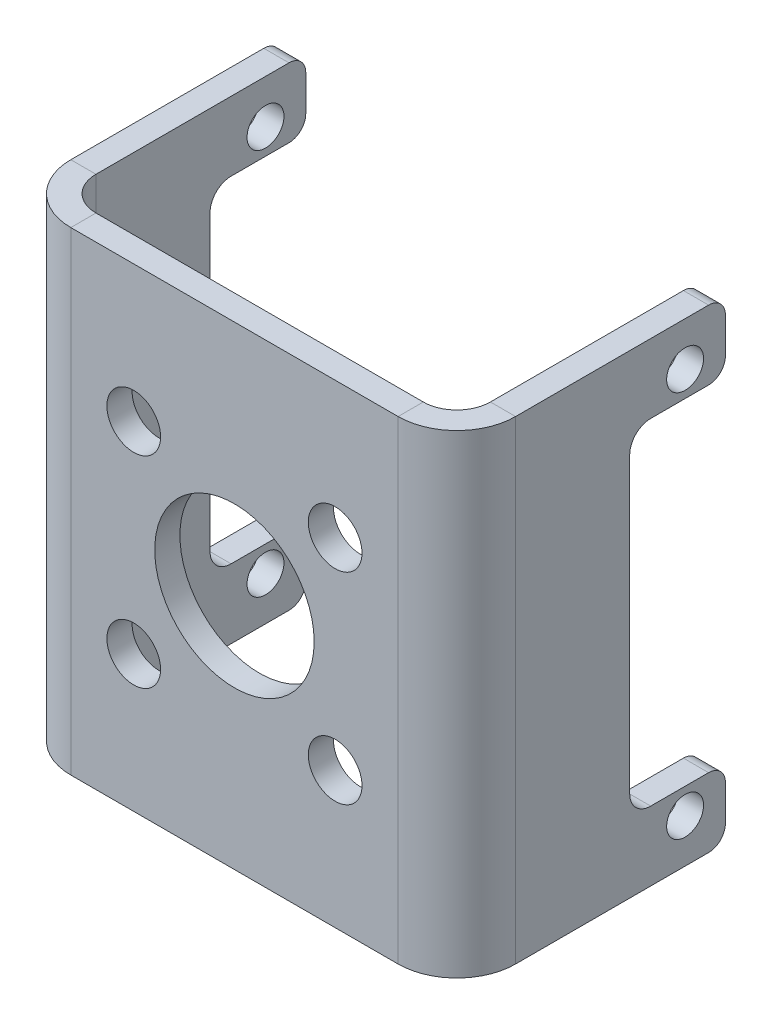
ISO-10303-21;
HEADER;
FILE_DESCRIPTION(('STEP AP214'),'2;1');
FILE_NAME('part.step','',(''),(''),'','','');
FILE_SCHEMA(('AUTOMOTIVE_DESIGN { 1 0 10303 214 1 1 1 1 }'));
ENDSEC;
DATA;
#1=APPLICATION_CONTEXT('core data for automotive mechanical design processes');
#2=APPLICATION_PROTOCOL_DEFINITION('international standard','automotive_design',2000,#1);
#3=PRODUCT_CONTEXT('',#1,'mechanical');
#4=PRODUCT('Part','Part','',(#3));
#5=PRODUCT_RELATED_PRODUCT_CATEGORY('part','',(#4));
#6=PRODUCT_DEFINITION_FORMATION('','',#4);
#7=PRODUCT_DEFINITION_CONTEXT('part definition',#1,'design');
#8=PRODUCT_DEFINITION('design','',#6,#7);
#9=PRODUCT_DEFINITION_SHAPE('','',#8);
#10=(LENGTH_UNIT() NAMED_UNIT(*) SI_UNIT(.MILLI.,.METRE.));
#11=(NAMED_UNIT(*) PLANE_ANGLE_UNIT() SI_UNIT($,.RADIAN.));
#12=(NAMED_UNIT(*) SI_UNIT($,.STERADIAN.) SOLID_ANGLE_UNIT());
#13=UNCERTAINTY_MEASURE_WITH_UNIT(LENGTH_MEASURE(1.E-05),#10,'distance_accuracy_value','');
#14=(GEOMETRIC_REPRESENTATION_CONTEXT(3) GLOBAL_UNCERTAINTY_ASSIGNED_CONTEXT((#13)) GLOBAL_UNIT_ASSIGNED_CONTEXT((#10,
#11,#12)) REPRESENTATION_CONTEXT('',''));
#15=CARTESIAN_POINT('',(0.,0.,0.));
#16=DIRECTION('',(0.,0.,1.));
#17=DIRECTION('',(1.,0.,0.));
#18=AXIS2_PLACEMENT_3D('',#15,#16,#17);
#19=CARTESIAN_POINT('',(13.25,14.125,-16.));
#20=DIRECTION('',(0.,0.,1.));
#21=DIRECTION('',(1.,0.,0.));
#22=AXIS2_PLACEMENT_3D('',#19,#20,#21);
#23=PLANE('',#22);
#24=DIRECTION('',(0.,1.,0.));
#25=VECTOR('',#24,1.);
#26=CARTESIAN_POINT('',(13.25,14.125,-16.));
#27=LINE('',#26,#25);
#28=CARTESIAN_POINT('',(13.25,-13.125,-16.));
#29=VERTEX_POINT('',#28);
#30=CARTESIAN_POINT('',(13.25,-11.0000000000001,-16.));
#31=VERTEX_POINT('',#30);
#32=EDGE_CURVE('E364',#29,#31,#27,.T.);
#33=ORIENTED_EDGE('',*,*,#32,.F.);
#34=DIRECTION('',(-1.,0.,0.));
#35=VECTOR('',#34,1.);
#36=CARTESIAN_POINT('',(13.25,-13.125,-16.));
#37=LINE('',#36,#35);
#38=CARTESIAN_POINT('',(11.75,-13.125,-16.));
#39=VERTEX_POINT('',#38);
#40=EDGE_CURVE('E500',#29,#39,#37,.T.);
#41=ORIENTED_EDGE('',*,*,#40,.T.);
#42=DIRECTION('',(0.,1.,0.));
#43=VECTOR('',#42,1.);
#44=CARTESIAN_POINT('',(11.75,14.125,-16.));
#45=LINE('',#44,#43);
#46=CARTESIAN_POINT('',(11.75,-11.0000000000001,-16.));
#47=VERTEX_POINT('',#46);
#48=EDGE_CURVE('E376',#39,#47,#45,.T.);
#49=ORIENTED_EDGE('',*,*,#48,.T.);
#50=DIRECTION('',(1.,0.,0.));
#51=VECTOR('',#50,1.);
#52=CARTESIAN_POINT('',(13.25,-11.0000000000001,-16.));
#53=LINE('',#52,#51);
#54=EDGE_CURVE('E496',#47,#31,#53,.T.);
#55=ORIENTED_EDGE('',*,*,#54,.T.);
#56=EDGE_LOOP('',(#33,#41,#49,#55));
#57=FACE_BOUND('',#56,.T.);
#58=ADVANCED_FACE('F46',(#57),#23,.F.);
#59=CARTESIAN_POINT('',(-13.25,-14.125,-16.));
#60=DIRECTION('',(0.,0.,1.));
#61=DIRECTION('',(1.,0.,0.));
#62=AXIS2_PLACEMENT_3D('',#59,#60,#61);
#63=PLANE('',#62);
#64=DIRECTION('',(0.,-1.,0.));
#65=VECTOR('',#64,1.);
#66=CARTESIAN_POINT('',(-11.75,-14.125,-16.));
#67=LINE('',#66,#65);
#68=CARTESIAN_POINT('',(-11.75,-11.0000000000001,-16.));
#69=VERTEX_POINT('',#68);
#70=CARTESIAN_POINT('',(-11.75,-13.125,-16.));
#71=VERTEX_POINT('',#70);
#72=EDGE_CURVE('E316',#69,#71,#67,.T.);
#73=ORIENTED_EDGE('',*,*,#72,.T.);
#74=DIRECTION('',(1.,0.,0.));
#75=VECTOR('',#74,1.);
#76=CARTESIAN_POINT('',(-13.25,-13.125,-16.));
#77=LINE('',#76,#75);
#78=CARTESIAN_POINT('',(-13.25,-13.125,-16.));
#79=VERTEX_POINT('',#78);
#80=EDGE_CURVE('E55',#71,#79,#77,.F.);
#81=ORIENTED_EDGE('',*,*,#80,.T.);
#82=DIRECTION('',(0.,-1.,0.));
#83=VECTOR('',#82,1.);
#84=CARTESIAN_POINT('',(-13.25,-14.125,-16.));
#85=LINE('',#84,#83);
#86=CARTESIAN_POINT('',(-13.25,-11.0000000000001,-16.));
#87=VERTEX_POINT('',#86);
#88=EDGE_CURVE('E298',#87,#79,#85,.T.);
#89=ORIENTED_EDGE('',*,*,#88,.F.);
#90=DIRECTION('',(1.,0.,0.));
#91=VECTOR('',#90,1.);
#92=CARTESIAN_POINT('',(-13.25,-11.0000000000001,-16.));
#93=LINE('',#92,#91);
#94=EDGE_CURVE('E587',#87,#69,#93,.T.);
#95=ORIENTED_EDGE('',*,*,#94,.T.);
#96=EDGE_LOOP('',(#73,#81,#89,#95));
#97=FACE_BOUND('',#96,.T.);
#98=ADVANCED_FACE('F595',(#97),#63,.F.);
#99=CARTESIAN_POINT('',(0.,0.,-1.5));
#100=DIRECTION('',(0.,0.,1.));
#101=DIRECTION('',(1.,0.,0.));
#102=AXIS2_PLACEMENT_3D('',#99,#100,#101);
#103=PLANE('',#102);
#104=CARTESIAN_POINT('',(6.,6.,-1.5));
#105=DIRECTION('',(0.,0.,1.));
#106=DIRECTION('',(1.,0.,0.));
#107=AXIS2_PLACEMENT_3D('',#104,#105,#106);
#108=CIRCLE('',#107,1.6);
#109=CARTESIAN_POINT('',(7.6,6.,-1.5));
#110=VERTEX_POINT('',#109);
#111=EDGE_CURVE('E616',#110,#110,#108,.T.);
#112=ORIENTED_EDGE('',*,*,#111,.T.);
#113=EDGE_LOOP('',(#112));
#114=FACE_BOUND('',#113,.T.);
#115=CARTESIAN_POINT('',(6.,-6.,-1.5));
#116=DIRECTION('',(0.,0.,1.));
#117=DIRECTION('',(1.,0.,0.));
#118=AXIS2_PLACEMENT_3D('',#115,#116,#117);
#119=CIRCLE('',#118,1.6);
#120=CARTESIAN_POINT('',(7.6,-6.,-1.5));
#121=VERTEX_POINT('',#120);
#122=EDGE_CURVE('E621',#121,#121,#119,.T.);
#123=ORIENTED_EDGE('',*,*,#122,.T.);
#124=EDGE_LOOP('',(#123));
#125=FACE_BOUND('',#124,.T.);
#126=CARTESIAN_POINT('',(0.,0.,-1.5));
#127=DIRECTION('',(0.,0.,1.));
#128=DIRECTION('',(1.,0.,0.));
#129=AXIS2_PLACEMENT_3D('',#126,#127,#128);
#130=CIRCLE('',#129,4.75);
#131=CARTESIAN_POINT('',(4.75,0.,-1.5));
#132=VERTEX_POINT('',#131);
#133=EDGE_CURVE('E625',#132,#132,#130,.T.);
#134=ORIENTED_EDGE('',*,*,#133,.T.);
#135=EDGE_LOOP('',(#134));
#136=FACE_BOUND('',#135,.T.);
#137=CARTESIAN_POINT('',(-6.,-6.,-1.5));
#138=DIRECTION('',(0.,0.,1.));
#139=DIRECTION('',(1.,0.,0.));
#140=AXIS2_PLACEMENT_3D('',#137,#138,#139);
#141=CIRCLE('',#140,1.6);
#142=CARTESIAN_POINT('',(-4.4,-6.,-1.5));
#143=VERTEX_POINT('',#142);
#144=EDGE_CURVE('E629',#143,#143,#141,.T.);
#145=ORIENTED_EDGE('',*,*,#144,.T.);
#146=EDGE_LOOP('',(#145));
#147=FACE_BOUND('',#146,.T.);
#148=CARTESIAN_POINT('',(-6.,6.,-1.5));
#149=DIRECTION('',(0.,0.,1.));
#150=DIRECTION('',(1.,0.,0.));
#151=AXIS2_PLACEMENT_3D('',#148,#149,#150);
#152=CIRCLE('',#151,1.6);
#153=CARTESIAN_POINT('',(-4.4,6.,-1.5));
#154=VERTEX_POINT('',#153);
#155=EDGE_CURVE('E633',#154,#154,#152,.T.);
#156=ORIENTED_EDGE('',*,*,#155,.T.);
#157=EDGE_LOOP('',(#156));
#158=FACE_BOUND('',#157,.T.);
#159=DIRECTION('',(0.,1.,0.));
#160=VECTOR('',#159,1.);
#161=CARTESIAN_POINT('',(-9.75000000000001,14.125,-1.5));
#162=LINE('',#161,#160);
#163=CARTESIAN_POINT('',(-9.75000000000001,14.125,-1.5));
#164=VERTEX_POINT('',#163);
#165=CARTESIAN_POINT('',(-9.75000000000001,-14.125,-1.5));
#166=VERTEX_POINT('',#165);
#167=EDGE_CURVE('E328',#164,#166,#162,.F.);
#168=ORIENTED_EDGE('',*,*,#167,.F.);
#169=DIRECTION('',(-1.,0.,0.));
#170=VECTOR('',#169,1.);
#171=CARTESIAN_POINT('',(11.75,14.125,-1.5));
#172=LINE('',#171,#170);
#173=CARTESIAN_POINT('',(9.75000000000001,14.125,-1.5));
#174=VERTEX_POINT('',#173);
#175=EDGE_CURVE('E414',#174,#164,#172,.T.);
#176=ORIENTED_EDGE('',*,*,#175,.F.);
#177=DIRECTION('',(0.,-1.,0.));
#178=VECTOR('',#177,1.);
#179=CARTESIAN_POINT('',(9.75000000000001,-14.125,-1.5));
#180=LINE('',#179,#178);
#181=CARTESIAN_POINT('',(9.75000000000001,-14.125,-1.5));
#182=VERTEX_POINT('',#181);
#183=EDGE_CURVE('E396',#182,#174,#180,.F.);
#184=ORIENTED_EDGE('',*,*,#183,.F.);
#185=DIRECTION('',(1.,0.,0.));
#186=VECTOR('',#185,1.);
#187=CARTESIAN_POINT('',(11.75,-14.125,-1.5));
#188=LINE('',#187,#186);
#189=EDGE_CURVE('E410',#166,#182,#188,.T.);
#190=ORIENTED_EDGE('',*,*,#189,.F.);
#191=EDGE_LOOP('',(#168,#176,#184,#190));
#192=FACE_BOUND('',#191,.T.);
#193=ADVANCED_FACE('F902',(#114,#125,#136,#147,#158,#192),#103,.F.);
#194=CARTESIAN_POINT('',(0.,0.,0.));
#195=DIRECTION('',(0.,0.,1.));
#196=DIRECTION('',(1.,0.,0.));
#197=AXIS2_PLACEMENT_3D('',#194,#195,#196);
#198=PLANE('',#197);
#199=CARTESIAN_POINT('',(6.,6.,0.));
#200=DIRECTION('',(0.,0.,1.));
#201=DIRECTION('',(1.,0.,0.));
#202=AXIS2_PLACEMENT_3D('',#199,#200,#201);
#203=CIRCLE('',#202,1.6);
#204=CARTESIAN_POINT('',(7.6,6.,0.));
#205=VERTEX_POINT('',#204);
#206=EDGE_CURVE('E641',#205,#205,#203,.T.);
#207=ORIENTED_EDGE('',*,*,#206,.F.);
#208=EDGE_LOOP('',(#207));
#209=FACE_BOUND('',#208,.T.);
#210=CARTESIAN_POINT('',(6.,-6.,0.));
#211=DIRECTION('',(0.,0.,1.));
#212=DIRECTION('',(1.,0.,0.));
#213=AXIS2_PLACEMENT_3D('',#210,#211,#212);
#214=CIRCLE('',#213,1.6);
#215=CARTESIAN_POINT('',(7.6,-6.,0.));
#216=VERTEX_POINT('',#215);
#217=EDGE_CURVE('E642',#216,#216,#214,.T.);
#218=ORIENTED_EDGE('',*,*,#217,.F.);
#219=EDGE_LOOP('',(#218));
#220=FACE_BOUND('',#219,.T.);
#221=CARTESIAN_POINT('',(0.,0.,0.));
#222=DIRECTION('',(0.,0.,1.));
#223=DIRECTION('',(1.,0.,0.));
#224=AXIS2_PLACEMENT_3D('',#221,#222,#223);
#225=CIRCLE('',#224,4.75);
#226=CARTESIAN_POINT('',(4.75,0.,0.));
#227=VERTEX_POINT('',#226);
#228=EDGE_CURVE('E653',#227,#227,#225,.T.);
#229=ORIENTED_EDGE('',*,*,#228,.F.);
#230=EDGE_LOOP('',(#229));
#231=FACE_BOUND('',#230,.T.);
#232=CARTESIAN_POINT('',(-6.,-6.,0.));
#233=DIRECTION('',(0.,0.,1.));
#234=DIRECTION('',(1.,0.,0.));
#235=AXIS2_PLACEMENT_3D('',#232,#233,#234);
#236=CIRCLE('',#235,1.6);
#237=CARTESIAN_POINT('',(-4.4,-6.,0.));
#238=VERTEX_POINT('',#237);
#239=EDGE_CURVE('E646',#238,#238,#236,.T.);
#240=ORIENTED_EDGE('',*,*,#239,.F.);
#241=EDGE_LOOP('',(#240));
#242=FACE_BOUND('',#241,.T.);
#243=CARTESIAN_POINT('',(-6.,6.,0.));
#244=DIRECTION('',(0.,0.,1.));
#245=DIRECTION('',(1.,0.,0.));
#246=AXIS2_PLACEMENT_3D('',#243,#244,#245);
#247=CIRCLE('',#246,1.6);
#248=CARTESIAN_POINT('',(-4.4,6.,0.));
#249=VERTEX_POINT('',#248);
#250=EDGE_CURVE('E637',#249,#249,#247,.T.);
#251=ORIENTED_EDGE('',*,*,#250,.F.);
#252=EDGE_LOOP('',(#251));
#253=FACE_BOUND('',#252,.T.);
#254=DIRECTION('',(-1.,0.,0.));
#255=VECTOR('',#254,1.);
#256=CARTESIAN_POINT('',(11.75,14.125,0.));
#257=LINE('',#256,#255);
#258=CARTESIAN_POINT('',(9.75000000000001,14.125,0.));
#259=VERTEX_POINT('',#258);
#260=CARTESIAN_POINT('',(-9.75000000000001,14.125,0.));
#261=VERTEX_POINT('',#260);
#262=EDGE_CURVE('E415',#259,#261,#257,.T.);
#263=ORIENTED_EDGE('',*,*,#262,.T.);
#264=DIRECTION('',(0.,1.,0.));
#265=VECTOR('',#264,1.);
#266=CARTESIAN_POINT('',(-9.75000000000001,14.125,0.));
#267=LINE('',#266,#265);
#268=CARTESIAN_POINT('',(-9.75000000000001,-14.125,0.));
#269=VERTEX_POINT('',#268);
#270=EDGE_CURVE('E264',#261,#269,#267,.F.);
#271=ORIENTED_EDGE('',*,*,#270,.T.);
#272=DIRECTION('',(1.,0.,0.));
#273=VECTOR('',#272,1.);
#274=CARTESIAN_POINT('',(11.75,-14.125,0.));
#275=LINE('',#274,#273);
#276=CARTESIAN_POINT('',(9.75000000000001,-14.125,0.));
#277=VERTEX_POINT('',#276);
#278=EDGE_CURVE('E406',#269,#277,#275,.T.);
#279=ORIENTED_EDGE('',*,*,#278,.T.);
#280=DIRECTION('',(0.,-1.,0.));
#281=VECTOR('',#280,1.);
#282=CARTESIAN_POINT('',(9.75000000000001,-14.125,0.));
#283=LINE('',#282,#281);
#284=EDGE_CURVE('E379',#277,#259,#283,.F.);
#285=ORIENTED_EDGE('',*,*,#284,.T.);
#286=EDGE_LOOP('',(#263,#271,#279,#285));
#287=FACE_BOUND('',#286,.T.);
#288=ADVANCED_FACE('F1159',(#209,#220,#231,#242,#253,#287),#198,.T.);
#289=CARTESIAN_POINT('',(11.75,14.125,-1.5));
#290=DIRECTION('',(0.,1.,0.));
#291=DIRECTION('',(-1.,0.,0.));
#292=AXIS2_PLACEMENT_3D('',#289,#290,#291);
#293=PLANE('',#292);
#294=ORIENTED_EDGE('',*,*,#175,.T.);
#295=DIRECTION('',(0.,0.,1.));
#296=VECTOR('',#295,1.);
#297=CARTESIAN_POINT('',(-9.75000000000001,14.125,-1.5));
#298=LINE('',#297,#296);
#299=EDGE_CURVE('E323',#164,#261,#298,.T.);
#300=ORIENTED_EDGE('',*,*,#299,.T.);
#301=ORIENTED_EDGE('',*,*,#262,.F.);
#302=DIRECTION('',(0.,0.,1.));
#303=VECTOR('',#302,1.);
#304=CARTESIAN_POINT('',(9.75000000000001,14.125,-1.5));
#305=LINE('',#304,#303);
#306=EDGE_CURVE('E402',#174,#259,#305,.T.);
#307=ORIENTED_EDGE('',*,*,#306,.F.);
#308=EDGE_LOOP('',(#294,#300,#301,#307));
#309=FACE_BOUND('',#308,.T.);
#310=ADVANCED_FACE('F1156',(#309),#293,.T.);
#311=CARTESIAN_POINT('',(11.75,-14.125,-1.5));
#312=DIRECTION('',(0.,-1.,0.));
#313=DIRECTION('',(1.,0.,0.));
#314=AXIS2_PLACEMENT_3D('',#311,#312,#313);
#315=PLANE('',#314);
#316=DIRECTION('',(0.,0.,1.));
#317=VECTOR('',#316,1.);
#318=CARTESIAN_POINT('',(-9.75000000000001,-14.125,-1.5));
#319=LINE('',#318,#317);
#320=EDGE_CURVE('E333',#166,#269,#319,.T.);
#321=ORIENTED_EDGE('',*,*,#320,.F.);
#322=ORIENTED_EDGE('',*,*,#189,.T.);
#323=DIRECTION('',(0.,0.,1.));
#324=VECTOR('',#323,1.);
#325=CARTESIAN_POINT('',(9.75000000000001,-14.125,-1.5));
#326=LINE('',#325,#324);
#327=EDGE_CURVE('E388',#182,#277,#326,.T.);
#328=ORIENTED_EDGE('',*,*,#327,.T.);
#329=ORIENTED_EDGE('',*,*,#278,.F.);
#330=EDGE_LOOP('',(#321,#322,#328,#329));
#331=FACE_BOUND('',#330,.T.);
#332=ADVANCED_FACE('F1167',(#331),#315,.T.);
#333=CARTESIAN_POINT('',(9.75000000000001,14.125,-3.5));
#334=DIRECTION('',(0.,1.,0.));
#335=DIRECTION('',(0.,0.,1.));
#336=AXIS2_PLACEMENT_3D('',#333,#334,#335);
#337=PLANE('',#336);
#338=DIRECTION('',(1.,0.,0.));
#339=VECTOR('',#338,1.);
#340=CARTESIAN_POINT('',(11.75,14.125,-3.49999999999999));
#341=LINE('',#340,#339);
#342=CARTESIAN_POINT('',(11.75,14.125,-3.49999999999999));
#343=VERTEX_POINT('',#342);
#344=CARTESIAN_POINT('',(13.25,14.125,-3.49999999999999));
#345=VERTEX_POINT('',#344);
#346=EDGE_CURVE('E337',#343,#345,#341,.T.);
#347=ORIENTED_EDGE('',*,*,#346,.F.);
#348=CARTESIAN_POINT('',(9.75000000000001,14.125,-3.5));
#349=DIRECTION('',(0.,-1.,0.));
#350=DIRECTION('',(0.,0.,-1.));
#351=AXIS2_PLACEMENT_3D('',#348,#349,#350);
#352=CIRCLE('',#351,2.);
#353=EDGE_CURVE('E392',#174,#343,#352,.F.);
#354=ORIENTED_EDGE('',*,*,#353,.F.);
#355=ORIENTED_EDGE('',*,*,#306,.T.);
#356=CARTESIAN_POINT('',(9.75000000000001,14.125,-3.5));
#357=DIRECTION('',(0.,-1.,0.));
#358=DIRECTION('',(0.,0.,-1.));
#359=AXIS2_PLACEMENT_3D('',#356,#357,#358);
#360=CIRCLE('',#359,3.5);
#361=EDGE_CURVE('E383',#259,#345,#360,.F.);
#362=ORIENTED_EDGE('',*,*,#361,.T.);
#363=EDGE_LOOP('',(#347,#354,#355,#362));
#364=FACE_BOUND('',#363,.T.);
#365=ADVANCED_FACE('F1146',(#364),#337,.T.);
#366=CARTESIAN_POINT('',(9.75000000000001,-14.125,-3.5));
#367=DIRECTION('',(0.,1.,0.));
#368=DIRECTION('',(0.,0.,1.));
#369=AXIS2_PLACEMENT_3D('',#366,#367,#368);
#370=PLANE('',#369);
#371=CARTESIAN_POINT('',(9.75000000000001,-14.125,-3.5));
#372=DIRECTION('',(0.,-1.,0.));
#373=DIRECTION('',(0.,0.,-1.));
#374=AXIS2_PLACEMENT_3D('',#371,#372,#373);
#375=CIRCLE('',#374,2.);
#376=CARTESIAN_POINT('',(11.75,-14.125,-3.49999999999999));
#377=VERTEX_POINT('',#376);
#378=EDGE_CURVE('E368',#377,#182,#375,.T.);
#379=ORIENTED_EDGE('',*,*,#378,.F.);
#380=DIRECTION('',(1.,0.,0.));
#381=VECTOR('',#380,1.);
#382=CARTESIAN_POINT('',(11.75,-14.125,-3.49999999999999));
#383=LINE('',#382,#381);
#384=CARTESIAN_POINT('',(13.25,-14.125,-3.49999999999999));
#385=VERTEX_POINT('',#384);
#386=EDGE_CURVE('E343',#377,#385,#383,.T.);
#387=ORIENTED_EDGE('',*,*,#386,.T.);
#388=CARTESIAN_POINT('',(9.75000000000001,-14.125,-3.5));
#389=DIRECTION('',(0.,-1.,0.));
#390=DIRECTION('',(0.,0.,-1.));
#391=AXIS2_PLACEMENT_3D('',#388,#389,#390);
#392=CIRCLE('',#391,3.5);
#393=EDGE_CURVE('E384',#385,#277,#392,.T.);
#394=ORIENTED_EDGE('',*,*,#393,.T.);
#395=ORIENTED_EDGE('',*,*,#327,.F.);
#396=EDGE_LOOP('',(#379,#387,#394,#395));
#397=FACE_BOUND('',#396,.T.);
#398=ADVANCED_FACE('F1164',(#397),#370,.F.);
#399=CARTESIAN_POINT('',(9.75000000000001,-14.125,-3.5));
#400=DIRECTION('',(0.,-1.,0.));
#401=DIRECTION('',(1.,0.,0.));
#402=AXIS2_PLACEMENT_3D('',#399,#400,#401);
#403=CYLINDRICAL_SURFACE('',#402,3.5);
#404=ORIENTED_EDGE('',*,*,#284,.F.);
#405=ORIENTED_EDGE('',*,*,#393,.F.);
#406=DIRECTION('',(0.,1.,0.));
#407=VECTOR('',#406,1.);
#408=CARTESIAN_POINT('',(13.25,0.,-3.49999999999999));
#409=LINE('',#408,#407);
#410=EDGE_CURVE('E347',#385,#345,#409,.T.);
#411=ORIENTED_EDGE('',*,*,#410,.T.);
#412=ORIENTED_EDGE('',*,*,#361,.F.);
#413=EDGE_LOOP('',(#404,#405,#411,#412));
#414=FACE_BOUND('',#413,.T.);
#415=ADVANCED_FACE('F1162',(#414),#403,.T.);
#416=CARTESIAN_POINT('',(9.75000000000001,-14.125,-3.5));
#417=DIRECTION('',(0.,-1.,0.));
#418=DIRECTION('',(1.,0.,0.));
#419=AXIS2_PLACEMENT_3D('',#416,#417,#418);
#420=CYLINDRICAL_SURFACE('',#419,2.);
#421=ORIENTED_EDGE('',*,*,#183,.T.);
#422=ORIENTED_EDGE('',*,*,#353,.T.);
#423=DIRECTION('',(0.,-1.,0.));
#424=VECTOR('',#423,1.);
#425=CARTESIAN_POINT('',(11.75,14.125,-3.49999999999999));
#426=LINE('',#425,#424);
#427=EDGE_CURVE('E340',#343,#377,#426,.T.);
#428=ORIENTED_EDGE('',*,*,#427,.T.);
#429=ORIENTED_EDGE('',*,*,#378,.T.);
#430=EDGE_LOOP('',(#421,#422,#428,#429));
#431=FACE_BOUND('',#430,.T.);
#432=ADVANCED_FACE('F1136',(#431),#420,.F.);
#433=CARTESIAN_POINT('',(13.25,-14.125,-16.));
#434=DIRECTION('',(0.,1.,0.));
#435=DIRECTION('',(0.,0.,1.));
#436=AXIS2_PLACEMENT_3D('',#433,#434,#435);
#437=PLANE('',#436);
#438=DIRECTION('',(0.,0.,-1.));
#439=VECTOR('',#438,1.);
#440=CARTESIAN_POINT('',(11.75,-14.125,-16.));
#441=LINE('',#440,#439);
#442=CARTESIAN_POINT('',(11.75,-14.125,-15.));
#443=VERTEX_POINT('',#442);
#444=EDGE_CURVE('E354',#377,#443,#441,.T.);
#445=ORIENTED_EDGE('',*,*,#444,.T.);
#446=DIRECTION('',(-1.,0.,0.));
#447=VECTOR('',#446,1.);
#448=CARTESIAN_POINT('',(13.25,-14.125,-15.));
#449=LINE('',#448,#447);
#450=CARTESIAN_POINT('',(13.25,-14.125,-15.));
#451=VERTEX_POINT('',#450);
#452=EDGE_CURVE('E516',#443,#451,#449,.F.);
#453=ORIENTED_EDGE('',*,*,#452,.T.);
#454=DIRECTION('',(0.,0.,-1.));
#455=VECTOR('',#454,1.);
#456=CARTESIAN_POINT('',(13.25,-14.125,-16.));
#457=LINE('',#456,#455);
#458=EDGE_CURVE('E355',#385,#451,#457,.T.);
#459=ORIENTED_EDGE('',*,*,#458,.F.);
#460=ORIENTED_EDGE('',*,*,#386,.F.);
#461=EDGE_LOOP('',(#445,#453,#459,#460));
#462=FACE_BOUND('',#461,.T.);
#463=ADVANCED_FACE('F1131',(#462),#437,.F.);
#464=CARTESIAN_POINT('',(13.25,14.125,-1.49999999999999));
#465=DIRECTION('',(0.,-1.,0.));
#466=DIRECTION('',(0.,0.,-1.));
#467=AXIS2_PLACEMENT_3D('',#464,#465,#466);
#468=PLANE('',#467);
#469=DIRECTION('',(0.,0.,1.));
#470=VECTOR('',#469,1.);
#471=CARTESIAN_POINT('',(13.25,14.125,-1.49999999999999));
#472=LINE('',#471,#470);
#473=CARTESIAN_POINT('',(13.25,14.125,-15.));
#474=VERTEX_POINT('',#473);
#475=EDGE_CURVE('E365',#474,#345,#472,.T.);
#476=ORIENTED_EDGE('',*,*,#475,.F.);
#477=DIRECTION('',(-1.,0.,0.));
#478=VECTOR('',#477,1.);
#479=CARTESIAN_POINT('',(13.25,14.125,-15.));
#480=LINE('',#479,#478);
#481=CARTESIAN_POINT('',(11.75,14.125,-15.));
#482=VERTEX_POINT('',#481);
#483=EDGE_CURVE('E544',#474,#482,#480,.T.);
#484=ORIENTED_EDGE('',*,*,#483,.T.);
#485=DIRECTION('',(0.,0.,1.));
#486=VECTOR('',#485,1.);
#487=CARTESIAN_POINT('',(11.75,14.125,-1.5));
#488=LINE('',#487,#486);
#489=EDGE_CURVE('E360',#482,#343,#488,.T.);
#490=ORIENTED_EDGE('',*,*,#489,.T.);
#491=ORIENTED_EDGE('',*,*,#346,.T.);
#492=EDGE_LOOP('',(#476,#484,#490,#491));
#493=FACE_BOUND('',#492,.T.);
#494=ADVANCED_FACE('F726',(#493),#468,.F.);
#495=CARTESIAN_POINT('',(13.25,0.,0.));
#496=DIRECTION('',(-1.,0.,0.));
#497=DIRECTION('',(0.,0.,1.));
#498=AXIS2_PLACEMENT_3D('',#495,#496,#497);
#499=PLANE('',#498);
#500=CARTESIAN_POINT('',(13.25,-11.5250000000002,-13.6000000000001));
#501=DIRECTION('',(1.,0.,0.));
#502=DIRECTION('',(0.,0.,-1.));
#503=AXIS2_PLACEMENT_3D('',#500,#501,#502);
#504=CIRCLE('',#503,1.1);
#505=CARTESIAN_POINT('',(13.25,-11.5250000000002,-14.7000000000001));
#506=VERTEX_POINT('',#505);
#507=EDGE_CURVE('E706',#506,#506,#504,.T.);
#508=ORIENTED_EDGE('',*,*,#507,.F.);
#509=EDGE_LOOP('',(#508));
#510=FACE_BOUND('',#509,.T.);
#511=CARTESIAN_POINT('',(13.25,11.5249999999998,-13.6000000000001));
#512=DIRECTION('',(1.,0.,0.));
#513=DIRECTION('',(0.,0.,-1.));
#514=AXIS2_PLACEMENT_3D('',#511,#512,#513);
#515=CIRCLE('',#514,1.1);
#516=CARTESIAN_POINT('',(13.25,11.5249999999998,-14.7000000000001));
#517=VERTEX_POINT('',#516);
#518=EDGE_CURVE('E693',#517,#517,#515,.T.);
#519=ORIENTED_EDGE('',*,*,#518,.F.);
#520=EDGE_LOOP('',(#519));
#521=FACE_BOUND('',#520,.T.);
#522=ORIENTED_EDGE('',*,*,#458,.T.);
#523=CARTESIAN_POINT('',(13.25,-13.125,-15.));
#524=DIRECTION('',(-1.,0.,0.));
#525=DIRECTION('',(0.,0.,1.));
#526=AXIS2_PLACEMENT_3D('',#523,#524,#525);
#527=CIRCLE('',#526,1.);
#528=EDGE_CURVE('E528',#451,#29,#527,.F.);
#529=ORIENTED_EDGE('',*,*,#528,.T.);
#530=ORIENTED_EDGE('',*,*,#32,.T.);
#531=CARTESIAN_POINT('',(13.25,-11.0000000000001,-15.));
#532=DIRECTION('',(-1.,0.,0.));
#533=DIRECTION('',(0.,0.,1.));
#534=AXIS2_PLACEMENT_3D('',#531,#532,#533);
#535=CIRCLE('',#534,1.);
#536=CARTESIAN_POINT('',(13.25,-10.0000000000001,-15.));
#537=VERTEX_POINT('',#536);
#538=EDGE_CURVE('E525',#31,#537,#535,.F.);
#539=ORIENTED_EDGE('',*,*,#538,.T.);
#540=DIRECTION('',(0.,0.,-1.));
#541=VECTOR('',#540,1.);
#542=CARTESIAN_POINT('',(13.25,-10.0000000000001,-10.3000000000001));
#543=LINE('',#542,#541);
#544=CARTESIAN_POINT('',(13.25,-10.0000000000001,-11.5500000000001));
#545=VERTEX_POINT('',#544);
#546=EDGE_CURVE('E681',#545,#537,#543,.T.);
#547=ORIENTED_EDGE('',*,*,#546,.F.);
#548=CARTESIAN_POINT('',(13.25,-8.75000000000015,-11.5500000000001));
#549=DIRECTION('',(-1.,0.,0.));
#550=DIRECTION('',(0.,0.,1.));
#551=AXIS2_PLACEMENT_3D('',#548,#549,#550);
#552=CIRCLE('',#551,1.25);
#553=CARTESIAN_POINT('',(13.25,-8.75000000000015,-10.3000000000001));
#554=VERTEX_POINT('',#553);
#555=EDGE_CURVE('E482',#545,#554,#552,.T.);
#556=ORIENTED_EDGE('',*,*,#555,.T.);
#557=DIRECTION('',(0.,-1.,0.));
#558=VECTOR('',#557,1.);
#559=CARTESIAN_POINT('',(13.25,9.99999999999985,-10.3000000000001));
#560=LINE('',#559,#558);
#561=CARTESIAN_POINT('',(13.25,8.74999999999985,-10.3000000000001));
#562=VERTEX_POINT('',#561);
#563=EDGE_CURVE('E686',#562,#554,#560,.T.);
#564=ORIENTED_EDGE('',*,*,#563,.F.);
#565=CARTESIAN_POINT('',(13.25,8.74999999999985,-11.5500000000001));
#566=DIRECTION('',(-1.,0.,0.));
#567=DIRECTION('',(0.,0.,1.));
#568=AXIS2_PLACEMENT_3D('',#565,#566,#567);
#569=CIRCLE('',#568,1.25);
#570=CARTESIAN_POINT('',(13.25,9.99999999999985,-11.5500000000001));
#571=VERTEX_POINT('',#570);
#572=EDGE_CURVE('E489',#562,#571,#569,.T.);
#573=ORIENTED_EDGE('',*,*,#572,.T.);
#574=DIRECTION('',(0.,0.,1.));
#575=VECTOR('',#574,1.);
#576=CARTESIAN_POINT('',(13.2500000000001,9.99999999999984,-39.9500000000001));
#577=LINE('',#576,#575);
#578=CARTESIAN_POINT('',(13.25,9.99999999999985,-15.));
#579=VERTEX_POINT('',#578);
#580=EDGE_CURVE('E690',#579,#571,#577,.T.);
#581=ORIENTED_EDGE('',*,*,#580,.F.);
#582=CARTESIAN_POINT('',(13.25,10.9999999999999,-15.));
#583=DIRECTION('',(-1.,0.,0.));
#584=DIRECTION('',(0.,0.,1.));
#585=AXIS2_PLACEMENT_3D('',#582,#583,#584);
#586=CIRCLE('',#585,1.);
#587=CARTESIAN_POINT('',(13.25,10.9999999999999,-16.));
#588=VERTEX_POINT('',#587);
#589=EDGE_CURVE('E522',#579,#588,#586,.F.);
#590=ORIENTED_EDGE('',*,*,#589,.T.);
#591=CARTESIAN_POINT('',(13.25,13.125,-16.));
#592=VERTEX_POINT('',#591);
#593=EDGE_CURVE('E359',#588,#592,#27,.T.);
#594=ORIENTED_EDGE('',*,*,#593,.T.);
#595=CARTESIAN_POINT('',(13.25,13.125,-15.));
#596=DIRECTION('',(-1.,0.,0.));
#597=DIRECTION('',(0.,0.,1.));
#598=AXIS2_PLACEMENT_3D('',#595,#596,#597);
#599=CIRCLE('',#598,1.);
#600=EDGE_CURVE('E519',#592,#474,#599,.F.);
#601=ORIENTED_EDGE('',*,*,#600,.T.);
#602=ORIENTED_EDGE('',*,*,#475,.T.);
#603=ORIENTED_EDGE('',*,*,#410,.F.);
#604=EDGE_LOOP('',(#522,#529,#530,#539,#547,#556,#564,#573,#581,#590,#594,#601,#602,#603));
#605=FACE_BOUND('',#604,.T.);
#606=ADVANCED_FACE('F722',(#510,#521,#605),#499,.F.);
#607=CARTESIAN_POINT('',(11.75,0.,0.));
#608=DIRECTION('',(-1.,0.,0.));
#609=DIRECTION('',(0.,0.,1.));
#610=AXIS2_PLACEMENT_3D('',#607,#608,#609);
#611=PLANE('',#610);
#612=CARTESIAN_POINT('',(11.75,-11.5250000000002,-13.6000000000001));
#613=DIRECTION('',(-1.,0.,0.));
#614=DIRECTION('',(0.,0.,1.));
#615=AXIS2_PLACEMENT_3D('',#612,#613,#614);
#616=CIRCLE('',#615,1.1);
#617=CARTESIAN_POINT('',(11.75,-11.5250000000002,-12.5000000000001));
#618=VERTEX_POINT('',#617);
#619=EDGE_CURVE('E440',#618,#618,#616,.T.);
#620=ORIENTED_EDGE('',*,*,#619,.F.);
#621=EDGE_LOOP('',(#620));
#622=FACE_BOUND('',#621,.T.);
#623=CARTESIAN_POINT('',(11.75,11.5249999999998,-13.6000000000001));
#624=DIRECTION('',(-1.,0.,0.));
#625=DIRECTION('',(0.,0.,1.));
#626=AXIS2_PLACEMENT_3D('',#623,#624,#625);
#627=CIRCLE('',#626,1.1);
#628=CARTESIAN_POINT('',(11.75,11.5249999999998,-12.5000000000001));
#629=VERTEX_POINT('',#628);
#630=EDGE_CURVE('E434',#629,#629,#627,.T.);
#631=ORIENTED_EDGE('',*,*,#630,.F.);
#632=EDGE_LOOP('',(#631));
#633=FACE_BOUND('',#632,.T.);
#634=ORIENTED_EDGE('',*,*,#48,.F.);
#635=CARTESIAN_POINT('',(11.75,-13.125,-15.));
#636=DIRECTION('',(-1.,0.,0.));
#637=DIRECTION('',(0.,0.,1.));
#638=AXIS2_PLACEMENT_3D('',#635,#636,#637);
#639=CIRCLE('',#638,1.);
#640=EDGE_CURVE('E513',#39,#443,#639,.T.);
#641=ORIENTED_EDGE('',*,*,#640,.T.);
#642=ORIENTED_EDGE('',*,*,#444,.F.);
#643=ORIENTED_EDGE('',*,*,#427,.F.);
#644=ORIENTED_EDGE('',*,*,#489,.F.);
#645=CARTESIAN_POINT('',(11.75,13.125,-15.));
#646=DIRECTION('',(-1.,0.,0.));
#647=DIRECTION('',(0.,0.,1.));
#648=AXIS2_PLACEMENT_3D('',#645,#646,#647);
#649=CIRCLE('',#648,1.);
#650=CARTESIAN_POINT('',(11.75,13.125,-16.));
#651=VERTEX_POINT('',#650);
#652=EDGE_CURVE('E504',#482,#651,#649,.T.);
#653=ORIENTED_EDGE('',*,*,#652,.T.);
#654=CARTESIAN_POINT('',(11.75,10.9999999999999,-16.));
#655=VERTEX_POINT('',#654);
#656=EDGE_CURVE('E372',#655,#651,#45,.T.);
#657=ORIENTED_EDGE('',*,*,#656,.F.);
#658=CARTESIAN_POINT('',(11.75,10.9999999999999,-15.));
#659=DIRECTION('',(-1.,0.,0.));
#660=DIRECTION('',(0.,0.,1.));
#661=AXIS2_PLACEMENT_3D('',#658,#659,#660);
#662=CIRCLE('',#661,1.);
#663=CARTESIAN_POINT('',(11.75,9.99999999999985,-15.));
#664=VERTEX_POINT('',#663);
#665=EDGE_CURVE('E507',#655,#664,#662,.T.);
#666=ORIENTED_EDGE('',*,*,#665,.T.);
#667=DIRECTION('',(0.,0.,-1.));
#668=VECTOR('',#667,1.);
#669=CARTESIAN_POINT('',(11.75,9.99999999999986,0.));
#670=LINE('',#669,#668);
#671=CARTESIAN_POINT('',(11.75,9.99999999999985,-11.5500000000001));
#672=VERTEX_POINT('',#671);
#673=EDGE_CURVE('E673',#672,#664,#670,.T.);
#674=ORIENTED_EDGE('',*,*,#673,.F.);
#675=CARTESIAN_POINT('',(11.75,8.74999999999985,-11.5500000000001));
#676=DIRECTION('',(-1.,0.,0.));
#677=DIRECTION('',(0.,0.,1.));
#678=AXIS2_PLACEMENT_3D('',#675,#676,#677);
#679=CIRCLE('',#678,1.25);
#680=CARTESIAN_POINT('',(11.75,8.74999999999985,-10.3000000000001));
#681=VERTEX_POINT('',#680);
#682=EDGE_CURVE('E493',#672,#681,#679,.F.);
#683=ORIENTED_EDGE('',*,*,#682,.T.);
#684=DIRECTION('',(0.,1.,0.));
#685=VECTOR('',#684,1.);
#686=CARTESIAN_POINT('',(11.75,0.,-10.3000000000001));
#687=LINE('',#686,#685);
#688=CARTESIAN_POINT('',(11.75,-8.75000000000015,-10.3000000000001));
#689=VERTEX_POINT('',#688);
#690=EDGE_CURVE('E435',#689,#681,#687,.T.);
#691=ORIENTED_EDGE('',*,*,#690,.F.);
#692=CARTESIAN_POINT('',(11.75,-8.75000000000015,-11.5500000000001));
#693=DIRECTION('',(-1.,0.,0.));
#694=DIRECTION('',(0.,0.,1.));
#695=AXIS2_PLACEMENT_3D('',#692,#693,#694);
#696=CIRCLE('',#695,1.25);
#697=CARTESIAN_POINT('',(11.75,-10.0000000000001,-11.5500000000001));
#698=VERTEX_POINT('',#697);
#699=EDGE_CURVE('E485',#689,#698,#696,.F.);
#700=ORIENTED_EDGE('',*,*,#699,.T.);
#701=DIRECTION('',(0.,0.,1.));
#702=VECTOR('',#701,1.);
#703=CARTESIAN_POINT('',(11.75,-10.0000000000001,0.));
#704=LINE('',#703,#702);
#705=CARTESIAN_POINT('',(11.75,-10.0000000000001,-15.));
#706=VERTEX_POINT('',#705);
#707=EDGE_CURVE('E666',#706,#698,#704,.T.);
#708=ORIENTED_EDGE('',*,*,#707,.F.);
#709=CARTESIAN_POINT('',(11.75,-11.0000000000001,-15.));
#710=DIRECTION('',(-1.,0.,0.));
#711=DIRECTION('',(0.,0.,1.));
#712=AXIS2_PLACEMENT_3D('',#709,#710,#711);
#713=CIRCLE('',#712,1.);
#714=EDGE_CURVE('E510',#706,#47,#713,.T.);
#715=ORIENTED_EDGE('',*,*,#714,.T.);
#716=EDGE_LOOP('',(#634,#641,#642,#643,#644,#653,#657,#666,#674,#683,#691,#700,#708,#715));
#717=FACE_BOUND('',#716,.T.);
#718=ADVANCED_FACE('F725',(#622,#633,#717),#611,.T.);
#719=ORIENTED_EDGE('',*,*,#593,.F.);
#720=DIRECTION('',(-1.,0.,0.));
#721=VECTOR('',#720,1.);
#722=CARTESIAN_POINT('',(13.25,10.9999999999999,-16.));
#723=LINE('',#722,#721);
#724=EDGE_CURVE('E537',#588,#655,#723,.T.);
#725=ORIENTED_EDGE('',*,*,#724,.T.);
#726=ORIENTED_EDGE('',*,*,#656,.T.);
#727=DIRECTION('',(-1.,0.,0.));
#728=VECTOR('',#727,1.);
#729=CARTESIAN_POINT('',(13.25,13.125,-16.));
#730=LINE('',#729,#728);
#731=EDGE_CURVE('E534',#651,#592,#730,.F.);
#732=ORIENTED_EDGE('',*,*,#731,.T.);
#733=EDGE_LOOP('',(#719,#725,#726,#732));
#734=FACE_BOUND('',#733,.T.);
#735=ADVANCED_FACE('F898',(#734),#23,.F.);
#736=CARTESIAN_POINT('',(-9.75000000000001,-14.125,-3.5));
#737=DIRECTION('',(0.,-1.,0.));
#738=DIRECTION('',(0.,0.,-1.));
#739=AXIS2_PLACEMENT_3D('',#736,#737,#738);
#740=PLANE('',#739);
#741=DIRECTION('',(-1.,0.,0.));
#742=VECTOR('',#741,1.);
#743=CARTESIAN_POINT('',(-11.75,-14.125,-3.49999999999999));
#744=LINE('',#743,#742);
#745=CARTESIAN_POINT('',(-11.75,-14.125,-3.49999999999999));
#746=VERTEX_POINT('',#745);
#747=CARTESIAN_POINT('',(-13.25,-14.125,-3.49999999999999));
#748=VERTEX_POINT('',#747);
#749=EDGE_CURVE('E611',#746,#748,#744,.T.);
#750=ORIENTED_EDGE('',*,*,#749,.F.);
#751=CARTESIAN_POINT('',(-9.75000000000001,-14.125,-3.5));
#752=DIRECTION('',(0.,1.,0.));
#753=DIRECTION('',(0.,0.,1.));
#754=AXIS2_PLACEMENT_3D('',#751,#752,#753);
#755=CIRCLE('',#754,2.);
#756=EDGE_CURVE('E268',#166,#746,#755,.F.);
#757=ORIENTED_EDGE('',*,*,#756,.F.);
#758=ORIENTED_EDGE('',*,*,#320,.T.);
#759=CARTESIAN_POINT('',(-9.75000000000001,-14.125,-3.5));
#760=DIRECTION('',(0.,1.,0.));
#761=DIRECTION('',(0.,0.,1.));
#762=AXIS2_PLACEMENT_3D('',#759,#760,#761);
#763=CIRCLE('',#762,3.5);
#764=EDGE_CURVE('E321',#269,#748,#763,.F.);
#765=ORIENTED_EDGE('',*,*,#764,.T.);
#766=EDGE_LOOP('',(#750,#757,#758,#765));
#767=FACE_BOUND('',#766,.T.);
#768=ADVANCED_FACE('F907',(#767),#740,.T.);
#769=CARTESIAN_POINT('',(-9.75000000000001,14.125,-3.5));
#770=DIRECTION('',(0.,-1.,0.));
#771=DIRECTION('',(0.,0.,-1.));
#772=AXIS2_PLACEMENT_3D('',#769,#770,#771);
#773=PLANE('',#772);
#774=CARTESIAN_POINT('',(-9.75000000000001,14.125,-3.5));
#775=DIRECTION('',(0.,1.,0.));
#776=DIRECTION('',(0.,0.,1.));
#777=AXIS2_PLACEMENT_3D('',#774,#775,#776);
#778=CIRCLE('',#777,2.);
#779=CARTESIAN_POINT('',(-11.75,14.125,-3.49999999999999));
#780=VERTEX_POINT('',#779);
#781=EDGE_CURVE('E275',#780,#164,#778,.T.);
#782=ORIENTED_EDGE('',*,*,#781,.F.);
#783=DIRECTION('',(-1.,0.,0.));
#784=VECTOR('',#783,1.);
#785=CARTESIAN_POINT('',(-11.75,14.125,-3.49999999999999));
#786=LINE('',#785,#784);
#787=CARTESIAN_POINT('',(-13.25,14.125,-3.49999999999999));
#788=VERTEX_POINT('',#787);
#789=EDGE_CURVE('E272',#780,#788,#786,.T.);
#790=ORIENTED_EDGE('',*,*,#789,.T.);
#791=CARTESIAN_POINT('',(-9.75000000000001,14.125,-3.5));
#792=DIRECTION('',(0.,1.,0.));
#793=DIRECTION('',(0.,0.,1.));
#794=AXIS2_PLACEMENT_3D('',#791,#792,#793);
#795=CIRCLE('',#794,3.5);
#796=EDGE_CURVE('E257',#788,#261,#795,.T.);
#797=ORIENTED_EDGE('',*,*,#796,.T.);
#798=ORIENTED_EDGE('',*,*,#299,.F.);
#799=EDGE_LOOP('',(#782,#790,#797,#798));
#800=FACE_BOUND('',#799,.T.);
#801=ADVANCED_FACE('F273',(#800),#773,.F.);
#802=CARTESIAN_POINT('',(-9.75000000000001,14.125,-3.5));
#803=DIRECTION('',(0.,1.,0.));
#804=DIRECTION('',(-1.,0.,0.));
#805=AXIS2_PLACEMENT_3D('',#802,#803,#804);
#806=CYLINDRICAL_SURFACE('',#805,3.5);
#807=ORIENTED_EDGE('',*,*,#270,.F.);
#808=ORIENTED_EDGE('',*,*,#796,.F.);
#809=DIRECTION('',(0.,-1.,0.));
#810=VECTOR('',#809,1.);
#811=CARTESIAN_POINT('',(-13.25,0.,-3.49999999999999));
#812=LINE('',#811,#810);
#813=EDGE_CURVE('E261',#788,#748,#812,.T.);
#814=ORIENTED_EDGE('',*,*,#813,.T.);
#815=ORIENTED_EDGE('',*,*,#764,.F.);
#816=EDGE_LOOP('',(#807,#808,#814,#815));
#817=FACE_BOUND('',#816,.T.);
#818=ADVANCED_FACE('F259',(#817),#806,.T.);
#819=CARTESIAN_POINT('',(-9.75000000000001,14.125,-3.5));
#820=DIRECTION('',(0.,1.,0.));
#821=DIRECTION('',(-1.,0.,0.));
#822=AXIS2_PLACEMENT_3D('',#819,#820,#821);
#823=CYLINDRICAL_SURFACE('',#822,2.);
#824=ORIENTED_EDGE('',*,*,#167,.T.);
#825=ORIENTED_EDGE('',*,*,#756,.T.);
#826=DIRECTION('',(0.,1.,0.));
#827=VECTOR('',#826,1.);
#828=CARTESIAN_POINT('',(-11.75,-14.125,-3.49999999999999));
#829=LINE('',#828,#827);
#830=EDGE_CURVE('E281',#746,#780,#829,.T.);
#831=ORIENTED_EDGE('',*,*,#830,.T.);
#832=ORIENTED_EDGE('',*,*,#781,.T.);
#833=EDGE_LOOP('',(#824,#825,#831,#832));
#834=FACE_BOUND('',#833,.T.);
#835=ADVANCED_FACE('F1124',(#834),#823,.F.);
#836=CARTESIAN_POINT('',(-13.25,14.125,-16.));
#837=DIRECTION('',(0.,-1.,0.));
#838=DIRECTION('',(0.,0.,-1.));
#839=AXIS2_PLACEMENT_3D('',#836,#837,#838);
#840=PLANE('',#839);
#841=DIRECTION('',(0.,0.,-1.));
#842=VECTOR('',#841,1.);
#843=CARTESIAN_POINT('',(-11.75,14.125,-16.));
#844=LINE('',#843,#842);
#845=CARTESIAN_POINT('',(-11.75,14.125,-15.));
#846=VERTEX_POINT('',#845);
#847=EDGE_CURVE('E292',#780,#846,#844,.T.);
#848=ORIENTED_EDGE('',*,*,#847,.T.);
#849=DIRECTION('',(1.,0.,0.));
#850=VECTOR('',#849,1.);
#851=CARTESIAN_POINT('',(-13.25,14.125,-15.));
#852=LINE('',#851,#850);
#853=CARTESIAN_POINT('',(-13.25,14.125,-15.));
#854=VERTEX_POINT('',#853);
#855=EDGE_CURVE('E296',#846,#854,#852,.F.);
#856=ORIENTED_EDGE('',*,*,#855,.T.);
#857=DIRECTION('',(0.,0.,-1.));
#858=VECTOR('',#857,1.);
#859=CARTESIAN_POINT('',(-13.25,14.125,-16.));
#860=LINE('',#859,#858);
#861=EDGE_CURVE('E287',#788,#854,#860,.T.);
#862=ORIENTED_EDGE('',*,*,#861,.F.);
#863=ORIENTED_EDGE('',*,*,#789,.F.);
#864=EDGE_LOOP('',(#848,#856,#862,#863));
#865=FACE_BOUND('',#864,.T.);
#866=ADVANCED_FACE('F294',(#865),#840,.F.);
#867=CARTESIAN_POINT('',(-13.25,-14.125,-1.49999999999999));
#868=DIRECTION('',(0.,1.,0.));
#869=DIRECTION('',(0.,0.,1.));
#870=AXIS2_PLACEMENT_3D('',#867,#868,#869);
#871=PLANE('',#870);
#872=DIRECTION('',(0.,0.,1.));
#873=VECTOR('',#872,1.);
#874=CARTESIAN_POINT('',(-13.25,-14.125,-1.49999999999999));
#875=LINE('',#874,#873);
#876=CARTESIAN_POINT('',(-13.25,-14.125,-15.));
#877=VERTEX_POINT('',#876);
#878=EDGE_CURVE('E290',#877,#748,#875,.T.);
#879=ORIENTED_EDGE('',*,*,#878,.F.);
#880=DIRECTION('',(1.,0.,0.));
#881=VECTOR('',#880,1.);
#882=CARTESIAN_POINT('',(-13.25,-14.125,-15.));
#883=LINE('',#882,#881);
#884=CARTESIAN_POINT('',(-11.75,-14.125,-15.));
#885=VERTEX_POINT('',#884);
#886=EDGE_CURVE('E583',#877,#885,#883,.T.);
#887=ORIENTED_EDGE('',*,*,#886,.T.);
#888=DIRECTION('',(0.,0.,1.));
#889=VECTOR('',#888,1.);
#890=CARTESIAN_POINT('',(-11.75,-14.125,-1.5));
#891=LINE('',#890,#889);
#892=EDGE_CURVE('E299',#885,#746,#891,.T.);
#893=ORIENTED_EDGE('',*,*,#892,.T.);
#894=ORIENTED_EDGE('',*,*,#749,.T.);
#895=EDGE_LOOP('',(#879,#887,#893,#894));
#896=FACE_BOUND('',#895,.T.);
#897=ADVANCED_FACE('F603',(#896),#871,.F.);
#898=CARTESIAN_POINT('',(-13.25,0.,0.));
#899=DIRECTION('',(1.,0.,0.));
#900=DIRECTION('',(0.,0.,-1.));
#901=AXIS2_PLACEMENT_3D('',#898,#899,#900);
#902=PLANE('',#901);
#903=CARTESIAN_POINT('',(-13.2500000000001,-11.5250000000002,-13.6000000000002));
#904=DIRECTION('',(1.,0.,0.));
#905=DIRECTION('',(0.,0.,-1.));
#906=AXIS2_PLACEMENT_3D('',#903,#904,#905);
#907=CIRCLE('',#906,1.1);
#908=CARTESIAN_POINT('',(-13.2500000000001,-11.5250000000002,-14.7000000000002));
#909=VERTEX_POINT('',#908);
#910=EDGE_CURVE('E702',#909,#909,#907,.T.);
#911=ORIENTED_EDGE('',*,*,#910,.T.);
#912=EDGE_LOOP('',(#911));
#913=FACE_BOUND('',#912,.T.);
#914=CARTESIAN_POINT('',(-13.2500000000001,11.5249999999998,-13.6000000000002));
#915=DIRECTION('',(1.,0.,0.));
#916=DIRECTION('',(0.,0.,-1.));
#917=AXIS2_PLACEMENT_3D('',#914,#915,#916);
#918=CIRCLE('',#917,1.1);
#919=CARTESIAN_POINT('',(-13.2500000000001,11.5249999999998,-14.7000000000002));
#920=VERTEX_POINT('',#919);
#921=EDGE_CURVE('E710',#920,#920,#918,.T.);
#922=ORIENTED_EDGE('',*,*,#921,.T.);
#923=EDGE_LOOP('',(#922));
#924=FACE_BOUND('',#923,.T.);
#925=CARTESIAN_POINT('',(-13.25,13.125,-16.));
#926=VERTEX_POINT('',#925);
#927=CARTESIAN_POINT('',(-13.25,10.9999999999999,-16.));
#928=VERTEX_POINT('',#927);
#929=EDGE_CURVE('E306',#926,#928,#85,.T.);
#930=ORIENTED_EDGE('',*,*,#929,.T.);
#931=CARTESIAN_POINT('',(-13.25,10.9999999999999,-15.));
#932=DIRECTION('',(1.,0.,0.));
#933=DIRECTION('',(0.,0.,-1.));
#934=AXIS2_PLACEMENT_3D('',#931,#932,#933);
#935=CIRCLE('',#934,1.);
#936=CARTESIAN_POINT('',(-13.2500000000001,9.99999999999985,-15.));
#937=VERTEX_POINT('',#936);
#938=EDGE_CURVE('E565',#928,#937,#935,.F.);
#939=ORIENTED_EDGE('',*,*,#938,.T.);
#940=DIRECTION('',(0.,0.,1.));
#941=VECTOR('',#940,1.);
#942=CARTESIAN_POINT('',(-13.25,9.99999999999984,-39.9500000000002));
#943=LINE('',#942,#941);
#944=CARTESIAN_POINT('',(-13.2500000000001,9.99999999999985,-11.5500000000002));
#945=VERTEX_POINT('',#944);
#946=EDGE_CURVE('E685',#937,#945,#943,.T.);
#947=ORIENTED_EDGE('',*,*,#946,.T.);
#948=CARTESIAN_POINT('',(-13.25,8.74999999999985,-11.5500000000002));
#949=DIRECTION('',(1.,0.,0.));
#950=DIRECTION('',(0.,0.,-1.));
#951=AXIS2_PLACEMENT_3D('',#948,#949,#950);
#952=CIRCLE('',#951,1.25);
#953=CARTESIAN_POINT('',(-13.2500000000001,8.74999999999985,-10.3000000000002));
#954=VERTEX_POINT('',#953);
#955=EDGE_CURVE('E473',#945,#954,#952,.T.);
#956=ORIENTED_EDGE('',*,*,#955,.T.);
#957=DIRECTION('',(0.,-1.,0.));
#958=VECTOR('',#957,1.);
#959=CARTESIAN_POINT('',(-13.2500000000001,9.99999999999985,-10.3000000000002));
#960=LINE('',#959,#958);
#961=CARTESIAN_POINT('',(-13.2500000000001,-8.75000000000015,-10.3000000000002));
#962=VERTEX_POINT('',#961);
#963=EDGE_CURVE('E696',#954,#962,#960,.T.);
#964=ORIENTED_EDGE('',*,*,#963,.T.);
#965=CARTESIAN_POINT('',(-13.25,-8.75000000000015,-11.5500000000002));
#966=DIRECTION('',(1.,0.,0.));
#967=DIRECTION('',(0.,0.,-1.));
#968=AXIS2_PLACEMENT_3D('',#965,#966,#967);
#969=CIRCLE('',#968,1.25);
#970=CARTESIAN_POINT('',(-13.2500000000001,-10.0000000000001,-11.5500000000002));
#971=VERTEX_POINT('',#970);
#972=EDGE_CURVE('E479',#962,#971,#969,.T.);
#973=ORIENTED_EDGE('',*,*,#972,.T.);
#974=DIRECTION('',(0.,0.,-1.));
#975=VECTOR('',#974,1.);
#976=CARTESIAN_POINT('',(-13.2500000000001,-10.0000000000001,-10.3000000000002));
#977=LINE('',#976,#975);
#978=CARTESIAN_POINT('',(-13.2500000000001,-10.0000000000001,-15.));
#979=VERTEX_POINT('',#978);
#980=EDGE_CURVE('E680',#971,#979,#977,.T.);
#981=ORIENTED_EDGE('',*,*,#980,.T.);
#982=CARTESIAN_POINT('',(-13.25,-11.0000000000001,-15.));
#983=DIRECTION('',(1.,0.,0.));
#984=DIRECTION('',(0.,0.,-1.));
#985=AXIS2_PLACEMENT_3D('',#982,#983,#984);
#986=CIRCLE('',#985,1.);
#987=EDGE_CURVE('E556',#979,#87,#986,.F.);
#988=ORIENTED_EDGE('',*,*,#987,.T.);
#989=ORIENTED_EDGE('',*,*,#88,.T.);
#990=CARTESIAN_POINT('',(-13.25,-13.125,-15.));
#991=DIRECTION('',(1.,0.,0.));
#992=DIRECTION('',(0.,0.,-1.));
#993=AXIS2_PLACEMENT_3D('',#990,#991,#992);
#994=CIRCLE('',#993,1.);
#995=EDGE_CURVE('E559',#79,#877,#994,.F.);
#996=ORIENTED_EDGE('',*,*,#995,.T.);
#997=ORIENTED_EDGE('',*,*,#878,.T.);
#998=ORIENTED_EDGE('',*,*,#813,.F.);
#999=ORIENTED_EDGE('',*,*,#861,.T.);
#1000=CARTESIAN_POINT('',(-13.25,13.125,-15.));
#1001=DIRECTION('',(1.,0.,0.));
#1002=DIRECTION('',(0.,0.,-1.));
#1003=AXIS2_PLACEMENT_3D('',#1000,#1001,#1002);
#1004=CIRCLE('',#1003,1.);
#1005=EDGE_CURVE('E562',#854,#926,#1004,.F.);
#1006=ORIENTED_EDGE('',*,*,#1005,.T.);
#1007=EDGE_LOOP('',(#930,#939,#947,#956,#964,#973,#981,#988,#989,#996,#997,#998,#999,#1006));
#1008=FACE_BOUND('',#1007,.T.);
#1009=ADVANCED_FACE('F286',(#913,#924,#1008),#902,.F.);
#1010=CARTESIAN_POINT('',(-11.75,0.,0.));
#1011=DIRECTION('',(1.,0.,0.));
#1012=DIRECTION('',(0.,0.,-1.));
#1013=AXIS2_PLACEMENT_3D('',#1010,#1011,#1012);
#1014=PLANE('',#1013);
#1015=CARTESIAN_POINT('',(-11.75,-11.5250000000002,-13.6000000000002));
#1016=DIRECTION('',(1.,0.,0.));
#1017=DIRECTION('',(0.,0.,-1.));
#1018=AXIS2_PLACEMENT_3D('',#1015,#1016,#1017);
#1019=CIRCLE('',#1018,1.1);
#1020=CARTESIAN_POINT('',(-11.75,-11.5250000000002,-14.7000000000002));
#1021=VERTEX_POINT('',#1020);
#1022=EDGE_CURVE('E436',#1021,#1021,#1019,.T.);
#1023=ORIENTED_EDGE('',*,*,#1022,.F.);
#1024=EDGE_LOOP('',(#1023));
#1025=FACE_BOUND('',#1024,.T.);
#1026=CARTESIAN_POINT('',(-11.75,11.5249999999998,-13.6000000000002));
#1027=DIRECTION('',(1.,0.,0.));
#1028=DIRECTION('',(0.,0.,-1.));
#1029=AXIS2_PLACEMENT_3D('',#1026,#1027,#1028);
#1030=CIRCLE('',#1029,1.1);
#1031=CARTESIAN_POINT('',(-11.75,11.5249999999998,-14.7000000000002));
#1032=VERTEX_POINT('',#1031);
#1033=EDGE_CURVE('E430',#1032,#1032,#1030,.T.);
#1034=ORIENTED_EDGE('',*,*,#1033,.F.);
#1035=EDGE_LOOP('',(#1034));
#1036=FACE_BOUND('',#1035,.T.);
#1037=DIRECTION('',(0.,0.,1.));
#1038=VECTOR('',#1037,1.);
#1039=CARTESIAN_POINT('',(-11.75,9.99999999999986,0.));
#1040=LINE('',#1039,#1038);
#1041=CARTESIAN_POINT('',(-11.75,9.99999999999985,-15.));
#1042=VERTEX_POINT('',#1041);
#1043=CARTESIAN_POINT('',(-11.75,9.99999999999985,-11.5500000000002));
#1044=VERTEX_POINT('',#1043);
#1045=EDGE_CURVE('E677',#1042,#1044,#1040,.T.);
#1046=ORIENTED_EDGE('',*,*,#1045,.F.);
#1047=CARTESIAN_POINT('',(-11.75,10.9999999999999,-15.));
#1048=DIRECTION('',(1.,0.,0.));
#1049=DIRECTION('',(0.,0.,-1.));
#1050=AXIS2_PLACEMENT_3D('',#1047,#1048,#1049);
#1051=CIRCLE('',#1050,1.);
#1052=CARTESIAN_POINT('',(-11.75,10.9999999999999,-16.));
#1053=VERTEX_POINT('',#1052);
#1054=EDGE_CURVE('E578',#1042,#1053,#1051,.T.);
#1055=ORIENTED_EDGE('',*,*,#1054,.T.);
#1056=CARTESIAN_POINT('',(-11.75,13.125,-16.));
#1057=VERTEX_POINT('',#1056);
#1058=EDGE_CURVE('E308',#1057,#1053,#67,.T.);
#1059=ORIENTED_EDGE('',*,*,#1058,.F.);
#1060=CARTESIAN_POINT('',(-11.75,13.125,-15.));
#1061=DIRECTION('',(1.,0.,0.));
#1062=DIRECTION('',(0.,0.,-1.));
#1063=AXIS2_PLACEMENT_3D('',#1060,#1061,#1062);
#1064=CIRCLE('',#1063,1.);
#1065=EDGE_CURVE('E575',#1057,#846,#1064,.T.);
#1066=ORIENTED_EDGE('',*,*,#1065,.T.);
#1067=ORIENTED_EDGE('',*,*,#847,.F.);
#1068=ORIENTED_EDGE('',*,*,#830,.F.);
#1069=ORIENTED_EDGE('',*,*,#892,.F.);
#1070=CARTESIAN_POINT('',(-11.75,-13.125,-15.));
#1071=DIRECTION('',(1.,0.,0.));
#1072=DIRECTION('',(0.,0.,-1.));
#1073=AXIS2_PLACEMENT_3D('',#1070,#1071,#1072);
#1074=CIRCLE('',#1073,1.);
#1075=EDGE_CURVE('E62',#885,#71,#1074,.T.);
#1076=ORIENTED_EDGE('',*,*,#1075,.T.);
#1077=ORIENTED_EDGE('',*,*,#72,.F.);
#1078=CARTESIAN_POINT('',(-11.75,-11.0000000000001,-15.));
#1079=DIRECTION('',(1.,0.,0.));
#1080=DIRECTION('',(0.,0.,-1.));
#1081=AXIS2_PLACEMENT_3D('',#1078,#1079,#1080);
#1082=CIRCLE('',#1081,1.);
#1083=CARTESIAN_POINT('',(-11.75,-10.0000000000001,-15.));
#1084=VERTEX_POINT('',#1083);
#1085=EDGE_CURVE('E70',#69,#1084,#1082,.T.);
#1086=ORIENTED_EDGE('',*,*,#1085,.T.);
#1087=DIRECTION('',(0.,0.,-1.));
#1088=VECTOR('',#1087,1.);
#1089=CARTESIAN_POINT('',(-11.75,-10.0000000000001,0.));
#1090=LINE('',#1089,#1088);
#1091=CARTESIAN_POINT('',(-11.75,-10.0000000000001,-11.5500000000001));
#1092=VERTEX_POINT('',#1091);
#1093=EDGE_CURVE('E669',#1092,#1084,#1090,.T.);
#1094=ORIENTED_EDGE('',*,*,#1093,.F.);
#1095=CARTESIAN_POINT('',(-11.75,-8.75000000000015,-11.5500000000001));
#1096=DIRECTION('',(1.,0.,0.));
#1097=DIRECTION('',(0.,0.,-1.));
#1098=AXIS2_PLACEMENT_3D('',#1095,#1096,#1097);
#1099=CIRCLE('',#1098,1.25);
#1100=CARTESIAN_POINT('',(-11.75,-8.75000000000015,-10.3000000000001));
#1101=VERTEX_POINT('',#1100);
#1102=EDGE_CURVE('E476',#1092,#1101,#1099,.F.);
#1103=ORIENTED_EDGE('',*,*,#1102,.T.);
#1104=DIRECTION('',(0.,-1.,0.));
#1105=VECTOR('',#1104,1.);
#1106=CARTESIAN_POINT('',(-11.75,0.,-10.3000000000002));
#1107=LINE('',#1106,#1105);
#1108=CARTESIAN_POINT('',(-11.75,8.74999999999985,-10.3000000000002));
#1109=VERTEX_POINT('',#1108);
#1110=EDGE_CURVE('E419',#1109,#1101,#1107,.T.);
#1111=ORIENTED_EDGE('',*,*,#1110,.F.);
#1112=CARTESIAN_POINT('',(-11.75,8.74999999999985,-11.5500000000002));
#1113=DIRECTION('',(1.,0.,0.));
#1114=DIRECTION('',(0.,0.,-1.));
#1115=AXIS2_PLACEMENT_3D('',#1112,#1113,#1114);
#1116=CIRCLE('',#1115,1.25);
#1117=EDGE_CURVE('E469',#1109,#1044,#1116,.F.);
#1118=ORIENTED_EDGE('',*,*,#1117,.T.);
#1119=EDGE_LOOP('',(#1046,#1055,#1059,#1066,#1067,#1068,#1069,#1076,#1077,#1086,#1094,#1103,
#1111,#1118));
#1120=FACE_BOUND('',#1119,.T.);
#1121=ADVANCED_FACE('F608',(#1025,#1036,#1120),#1014,.T.);
#1122=ORIENTED_EDGE('',*,*,#1058,.T.);
#1123=DIRECTION('',(-1.,0.,0.));
#1124=VECTOR('',#1123,1.);
#1125=CARTESIAN_POINT('',(-13.25,10.9999999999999,-16.));
#1126=LINE('',#1125,#1124);
#1127=EDGE_CURVE('E552',#1053,#928,#1126,.T.);
#1128=ORIENTED_EDGE('',*,*,#1127,.T.);
#1129=ORIENTED_EDGE('',*,*,#929,.F.);
#1130=DIRECTION('',(1.,0.,0.));
#1131=VECTOR('',#1130,1.);
#1132=CARTESIAN_POINT('',(-13.25,13.125,-16.));
#1133=LINE('',#1132,#1131);
#1134=EDGE_CURVE('E548',#926,#1057,#1133,.T.);
#1135=ORIENTED_EDGE('',*,*,#1134,.T.);
#1136=EDGE_LOOP('',(#1122,#1128,#1129,#1135));
#1137=FACE_BOUND('',#1136,.T.);
#1138=ADVANCED_FACE('F863',(#1137),#63,.F.);
#1139=CARTESIAN_POINT('',(-6.,6.,-16.));
#1140=DIRECTION('',(0.,0.,1.));
#1141=DIRECTION('',(1.,0.,0.));
#1142=AXIS2_PLACEMENT_3D('',#1139,#1140,#1141);
#1143=CYLINDRICAL_SURFACE('',#1142,1.6);
#1144=ORIENTED_EDGE('',*,*,#250,.T.);
#1145=EDGE_LOOP('',(#1144));
#1146=FACE_BOUND('',#1145,.T.);
#1147=ORIENTED_EDGE('',*,*,#155,.F.);
#1148=EDGE_LOOP('',(#1147));
#1149=FACE_BOUND('',#1148,.T.);
#1150=ADVANCED_FACE('F1109',(#1146,#1149),#1143,.F.);
#1151=CARTESIAN_POINT('',(-6.,-6.,-16.));
#1152=DIRECTION('',(0.,0.,1.));
#1153=DIRECTION('',(1.,0.,0.));
#1154=AXIS2_PLACEMENT_3D('',#1151,#1152,#1153);
#1155=CYLINDRICAL_SURFACE('',#1154,1.6);
#1156=ORIENTED_EDGE('',*,*,#239,.T.);
#1157=EDGE_LOOP('',(#1156));
#1158=FACE_BOUND('',#1157,.T.);
#1159=ORIENTED_EDGE('',*,*,#144,.F.);
#1160=EDGE_LOOP('',(#1159));
#1161=FACE_BOUND('',#1160,.T.);
#1162=ADVANCED_FACE('F1106',(#1158,#1161),#1155,.F.);
#1163=CARTESIAN_POINT('',(0.,0.,-16.));
#1164=DIRECTION('',(0.,0.,1.));
#1165=DIRECTION('',(1.,0.,0.));
#1166=AXIS2_PLACEMENT_3D('',#1163,#1164,#1165);
#1167=CYLINDRICAL_SURFACE('',#1166,4.75);
#1168=ORIENTED_EDGE('',*,*,#228,.T.);
#1169=EDGE_LOOP('',(#1168));
#1170=FACE_BOUND('',#1169,.T.);
#1171=ORIENTED_EDGE('',*,*,#133,.F.);
#1172=EDGE_LOOP('',(#1171));
#1173=FACE_BOUND('',#1172,.T.);
#1174=ADVANCED_FACE('F1101',(#1170,#1173),#1167,.F.);
#1175=CARTESIAN_POINT('',(6.,-6.,-16.));
#1176=DIRECTION('',(0.,0.,1.));
#1177=DIRECTION('',(1.,0.,0.));
#1178=AXIS2_PLACEMENT_3D('',#1175,#1176,#1177);
#1179=CYLINDRICAL_SURFACE('',#1178,1.6);
#1180=ORIENTED_EDGE('',*,*,#217,.T.);
#1181=EDGE_LOOP('',(#1180));
#1182=FACE_BOUND('',#1181,.T.);
#1183=ORIENTED_EDGE('',*,*,#122,.F.);
#1184=EDGE_LOOP('',(#1183));
#1185=FACE_BOUND('',#1184,.T.);
#1186=ADVANCED_FACE('F1095',(#1182,#1185),#1179,.F.);
#1187=CARTESIAN_POINT('',(6.,6.,-16.));
#1188=DIRECTION('',(0.,0.,1.));
#1189=DIRECTION('',(1.,0.,0.));
#1190=AXIS2_PLACEMENT_3D('',#1187,#1188,#1189);
#1191=CYLINDRICAL_SURFACE('',#1190,1.6);
#1192=ORIENTED_EDGE('',*,*,#206,.T.);
#1193=EDGE_LOOP('',(#1192));
#1194=FACE_BOUND('',#1193,.T.);
#1195=ORIENTED_EDGE('',*,*,#111,.F.);
#1196=EDGE_LOOP('',(#1195));
#1197=FACE_BOUND('',#1196,.T.);
#1198=ADVANCED_FACE('F1090',(#1194,#1197),#1191,.F.);
#1199=CARTESIAN_POINT('',(-13.2500000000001,-10.0000000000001,-10.3000000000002));
#1200=DIRECTION('',(0.,-1.,0.));
#1201=DIRECTION('',(0.,0.,-1.));
#1202=AXIS2_PLACEMENT_3D('',#1199,#1200,#1201);
#1203=PLANE('',#1202);
#1204=ORIENTED_EDGE('',*,*,#1093,.T.);
#1205=DIRECTION('',(1.,0.,0.));
#1206=VECTOR('',#1205,1.);
#1207=CARTESIAN_POINT('',(-13.2500000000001,-10.0000000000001,-15.));
#1208=LINE('',#1207,#1206);
#1209=EDGE_CURVE('E11',#1084,#979,#1208,.F.);
#1210=ORIENTED_EDGE('',*,*,#1209,.T.);
#1211=ORIENTED_EDGE('',*,*,#980,.F.);
#1212=DIRECTION('',(1.,0.,0.));
#1213=VECTOR('',#1212,1.);
#1214=CARTESIAN_POINT('',(-11.75,-10.0000000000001,-11.5500000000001));
#1215=LINE('',#1214,#1213);
#1216=EDGE_CURVE('E451',#971,#1092,#1215,.T.);
#1217=ORIENTED_EDGE('',*,*,#1216,.T.);
#1218=EDGE_LOOP('',(#1204,#1210,#1211,#1217));
#1219=FACE_BOUND('',#1218,.T.);
#1220=ADVANCED_FACE('F889',(#1219),#1203,.F.);
#1221=CARTESIAN_POINT('',(-13.25,9.99999999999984,-39.9500000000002));
#1222=DIRECTION('',(0.,1.,0.));
#1223=DIRECTION('',(0.,0.,1.));
#1224=AXIS2_PLACEMENT_3D('',#1221,#1222,#1223);
#1225=PLANE('',#1224);
#1226=ORIENTED_EDGE('',*,*,#946,.F.);
#1227=DIRECTION('',(-1.,0.,0.));
#1228=VECTOR('',#1227,1.);
#1229=CARTESIAN_POINT('',(-13.2499999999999,9.99999999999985,-15.));
#1230=LINE('',#1229,#1228);
#1231=EDGE_CURVE('E568',#937,#1042,#1230,.F.);
#1232=ORIENTED_EDGE('',*,*,#1231,.T.);
#1233=ORIENTED_EDGE('',*,*,#1045,.T.);
#1234=DIRECTION('',(1.,0.,0.));
#1235=VECTOR('',#1234,1.);
#1236=CARTESIAN_POINT('',(-13.2500000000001,9.99999999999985,-11.5500000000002));
#1237=LINE('',#1236,#1235);
#1238=EDGE_CURVE('E447',#1044,#945,#1237,.F.);
#1239=ORIENTED_EDGE('',*,*,#1238,.T.);
#1240=EDGE_LOOP('',(#1226,#1232,#1233,#1239));
#1241=FACE_BOUND('',#1240,.T.);
#1242=ADVANCED_FACE('F872',(#1241),#1225,.F.);
#1243=CARTESIAN_POINT('',(-13.2500000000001,9.99999999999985,-10.3000000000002));
#1244=DIRECTION('',(0.,0.,1.));
#1245=DIRECTION('',(1.,0.,0.));
#1246=AXIS2_PLACEMENT_3D('',#1243,#1244,#1245);
#1247=PLANE('',#1246);
#1248=ORIENTED_EDGE('',*,*,#963,.F.);
#1249=DIRECTION('',(1.,0.,0.));
#1250=VECTOR('',#1249,1.);
#1251=CARTESIAN_POINT('',(-11.75,8.74999999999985,-10.3000000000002));
#1252=LINE('',#1251,#1250);
#1253=EDGE_CURVE('E443',#954,#1109,#1252,.T.);
#1254=ORIENTED_EDGE('',*,*,#1253,.T.);
#1255=ORIENTED_EDGE('',*,*,#1110,.T.);
#1256=DIRECTION('',(1.,0.,0.));
#1257=VECTOR('',#1256,1.);
#1258=CARTESIAN_POINT('',(-13.2500000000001,-8.75000000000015,-10.3000000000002));
#1259=LINE('',#1258,#1257);
#1260=EDGE_CURVE('E429',#1101,#962,#1259,.F.);
#1261=ORIENTED_EDGE('',*,*,#1260,.T.);
#1262=EDGE_LOOP('',(#1248,#1254,#1255,#1261));
#1263=FACE_BOUND('',#1262,.T.);
#1264=ADVANCED_FACE('F881',(#1263),#1247,.F.);
#1265=CARTESIAN_POINT('',(-13.2500000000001,11.5249999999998,-13.6000000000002));
#1266=DIRECTION('',(1.,0.,0.));
#1267=DIRECTION('',(0.,0.,-1.));
#1268=AXIS2_PLACEMENT_3D('',#1265,#1266,#1267);
#1269=CYLINDRICAL_SURFACE('',#1268,1.1);
#1270=ORIENTED_EDGE('',*,*,#1033,.T.);
#1271=EDGE_LOOP('',(#1270));
#1272=FACE_BOUND('',#1271,.T.);
#1273=ORIENTED_EDGE('',*,*,#921,.F.);
#1274=EDGE_LOOP('',(#1273));
#1275=FACE_BOUND('',#1274,.T.);
#1276=ADVANCED_FACE('F1295',(#1272,#1275),#1269,.F.);
#1277=CARTESIAN_POINT('',(-13.2500000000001,-11.5250000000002,-13.6000000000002));
#1278=DIRECTION('',(1.,0.,0.));
#1279=DIRECTION('',(0.,0.,-1.));
#1280=AXIS2_PLACEMENT_3D('',#1277,#1278,#1279);
#1281=CYLINDRICAL_SURFACE('',#1280,1.1);
#1282=ORIENTED_EDGE('',*,*,#1022,.T.);
#1283=EDGE_LOOP('',(#1282));
#1284=FACE_BOUND('',#1283,.T.);
#1285=ORIENTED_EDGE('',*,*,#910,.F.);
#1286=EDGE_LOOP('',(#1285));
#1287=FACE_BOUND('',#1286,.T.);
#1288=ADVANCED_FACE('F1086',(#1284,#1287),#1281,.F.);
#1289=ORIENTED_EDGE('',*,*,#563,.T.);
#1290=DIRECTION('',(1.,0.,0.));
#1291=VECTOR('',#1290,1.);
#1292=CARTESIAN_POINT('',(11.75,-8.75000000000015,-10.3000000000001));
#1293=LINE('',#1292,#1291);
#1294=EDGE_CURVE('E463',#554,#689,#1293,.F.);
#1295=ORIENTED_EDGE('',*,*,#1294,.T.);
#1296=ORIENTED_EDGE('',*,*,#690,.T.);
#1297=DIRECTION('',(1.,0.,0.));
#1298=VECTOR('',#1297,1.);
#1299=CARTESIAN_POINT('',(13.25,8.74999999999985,-10.3000000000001));
#1300=LINE('',#1299,#1298);
#1301=EDGE_CURVE('E459',#681,#562,#1300,.T.);
#1302=ORIENTED_EDGE('',*,*,#1301,.T.);
#1303=EDGE_LOOP('',(#1289,#1295,#1296,#1302));
#1304=FACE_BOUND('',#1303,.T.);
#1305=ADVANCED_FACE('F938',(#1304),#1247,.F.);
#1306=ORIENTED_EDGE('',*,*,#546,.T.);
#1307=DIRECTION('',(1.,0.,0.));
#1308=VECTOR('',#1307,1.);
#1309=CARTESIAN_POINT('',(-13.2500000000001,-10.0000000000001,-15.0000000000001));
#1310=LINE('',#1309,#1308);
#1311=EDGE_CURVE('E531',#537,#706,#1310,.F.);
#1312=ORIENTED_EDGE('',*,*,#1311,.T.);
#1313=ORIENTED_EDGE('',*,*,#707,.T.);
#1314=DIRECTION('',(1.,0.,0.));
#1315=VECTOR('',#1314,1.);
#1316=CARTESIAN_POINT('',(13.25,-10.0000000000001,-11.5500000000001));
#1317=LINE('',#1316,#1315);
#1318=EDGE_CURVE('E455',#698,#545,#1317,.T.);
#1319=ORIENTED_EDGE('',*,*,#1318,.T.);
#1320=EDGE_LOOP('',(#1306,#1312,#1313,#1319));
#1321=FACE_BOUND('',#1320,.T.);
#1322=ADVANCED_FACE('F1078',(#1321),#1203,.F.);
#1323=ORIENTED_EDGE('',*,*,#673,.T.);
#1324=DIRECTION('',(-1.,0.,0.));
#1325=VECTOR('',#1324,1.);
#1326=CARTESIAN_POINT('',(-13.2500000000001,9.99999999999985,-15.0000000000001));
#1327=LINE('',#1326,#1325);
#1328=EDGE_CURVE('E541',#664,#579,#1327,.F.);
#1329=ORIENTED_EDGE('',*,*,#1328,.T.);
#1330=ORIENTED_EDGE('',*,*,#580,.T.);
#1331=DIRECTION('',(1.,0.,0.));
#1332=VECTOR('',#1331,1.);
#1333=CARTESIAN_POINT('',(11.75,9.99999999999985,-11.5500000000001));
#1334=LINE('',#1333,#1332);
#1335=EDGE_CURVE('E466',#571,#672,#1334,.F.);
#1336=ORIENTED_EDGE('',*,*,#1335,.T.);
#1337=EDGE_LOOP('',(#1323,#1329,#1330,#1336));
#1338=FACE_BOUND('',#1337,.T.);
#1339=ADVANCED_FACE('F929',(#1338),#1225,.F.);
#1340=ORIENTED_EDGE('',*,*,#630,.T.);
#1341=EDGE_LOOP('',(#1340));
#1342=FACE_BOUND('',#1341,.T.);
#1343=ORIENTED_EDGE('',*,*,#518,.T.);
#1344=EDGE_LOOP('',(#1343));
#1345=FACE_BOUND('',#1344,.T.);
#1346=ADVANCED_FACE('F720',(#1342,#1345),#1269,.F.);
#1347=ORIENTED_EDGE('',*,*,#619,.T.);
#1348=EDGE_LOOP('',(#1347));
#1349=FACE_BOUND('',#1348,.T.);
#1350=ORIENTED_EDGE('',*,*,#507,.T.);
#1351=EDGE_LOOP('',(#1350));
#1352=FACE_BOUND('',#1351,.T.);
#1353=ADVANCED_FACE('F1181',(#1349,#1352),#1281,.F.);
#1354=CARTESIAN_POINT('',(-13.2500000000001,8.74999999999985,-11.5500000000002));
#1355=DIRECTION('',(-1.,0.,0.));
#1356=DIRECTION('',(0.,0.,1.));
#1357=AXIS2_PLACEMENT_3D('',#1354,#1355,#1356);
#1358=CYLINDRICAL_SURFACE('',#1357,1.25);
#1359=ORIENTED_EDGE('',*,*,#955,.F.);
#1360=ORIENTED_EDGE('',*,*,#1238,.F.);
#1361=ORIENTED_EDGE('',*,*,#1117,.F.);
#1362=ORIENTED_EDGE('',*,*,#1253,.F.);
#1363=EDGE_LOOP('',(#1359,#1360,#1361,#1362));
#1364=FACE_BOUND('',#1363,.T.);
#1365=ADVANCED_FACE('F877',(#1364),#1358,.F.);
#1366=CARTESIAN_POINT('',(-13.2500000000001,-8.75000000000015,-11.5500000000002));
#1367=DIRECTION('',(-1.,0.,0.));
#1368=DIRECTION('',(0.,0.,1.));
#1369=AXIS2_PLACEMENT_3D('',#1366,#1367,#1368);
#1370=CYLINDRICAL_SURFACE('',#1369,1.25);
#1371=ORIENTED_EDGE('',*,*,#972,.F.);
#1372=ORIENTED_EDGE('',*,*,#1260,.F.);
#1373=ORIENTED_EDGE('',*,*,#1102,.F.);
#1374=ORIENTED_EDGE('',*,*,#1216,.F.);
#1375=EDGE_LOOP('',(#1371,#1372,#1373,#1374));
#1376=FACE_BOUND('',#1375,.T.);
#1377=ADVANCED_FACE('F885',(#1376),#1370,.F.);
#1378=CARTESIAN_POINT('',(-13.2500000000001,-8.75000000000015,-11.5500000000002));
#1379=DIRECTION('',(-1.,0.,0.));
#1380=DIRECTION('',(0.,0.,1.));
#1381=AXIS2_PLACEMENT_3D('',#1378,#1379,#1380);
#1382=CYLINDRICAL_SURFACE('',#1381,1.25);
#1383=ORIENTED_EDGE('',*,*,#699,.F.);
#1384=ORIENTED_EDGE('',*,*,#1294,.F.);
#1385=ORIENTED_EDGE('',*,*,#555,.F.);
#1386=ORIENTED_EDGE('',*,*,#1318,.F.);
#1387=EDGE_LOOP('',(#1383,#1384,#1385,#1386));
#1388=FACE_BOUND('',#1387,.T.);
#1389=ADVANCED_FACE('F942',(#1388),#1382,.F.);
#1390=CARTESIAN_POINT('',(-13.2500000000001,8.74999999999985,-11.5500000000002));
#1391=DIRECTION('',(-1.,0.,0.));
#1392=DIRECTION('',(0.,0.,1.));
#1393=AXIS2_PLACEMENT_3D('',#1390,#1391,#1392);
#1394=CYLINDRICAL_SURFACE('',#1393,1.25);
#1395=ORIENTED_EDGE('',*,*,#682,.F.);
#1396=ORIENTED_EDGE('',*,*,#1335,.F.);
#1397=ORIENTED_EDGE('',*,*,#572,.F.);
#1398=ORIENTED_EDGE('',*,*,#1301,.F.);
#1399=EDGE_LOOP('',(#1395,#1396,#1397,#1398));
#1400=FACE_BOUND('',#1399,.T.);
#1401=ADVANCED_FACE('F933',(#1400),#1394,.F.);
#1402=CARTESIAN_POINT('',(13.25,-13.125,-15.));
#1403=DIRECTION('',(-1.,0.,0.));
#1404=DIRECTION('',(0.,0.,1.));
#1405=AXIS2_PLACEMENT_3D('',#1402,#1403,#1404);
#1406=CYLINDRICAL_SURFACE('',#1405,1.);
#1407=ORIENTED_EDGE('',*,*,#528,.F.);
#1408=ORIENTED_EDGE('',*,*,#452,.F.);
#1409=ORIENTED_EDGE('',*,*,#640,.F.);
#1410=ORIENTED_EDGE('',*,*,#40,.F.);
#1411=EDGE_LOOP('',(#1407,#1408,#1409,#1410));
#1412=FACE_BOUND('',#1411,.T.);
#1413=ADVANCED_FACE('F739',(#1412),#1406,.T.);
#1414=CARTESIAN_POINT('',(13.25,-11.0000000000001,-15.));
#1415=DIRECTION('',(1.,0.,0.));
#1416=DIRECTION('',(0.,0.,-1.));
#1417=AXIS2_PLACEMENT_3D('',#1414,#1415,#1416);
#1418=CYLINDRICAL_SURFACE('',#1417,1.);
#1419=ORIENTED_EDGE('',*,*,#714,.F.);
#1420=ORIENTED_EDGE('',*,*,#1311,.F.);
#1421=ORIENTED_EDGE('',*,*,#538,.F.);
#1422=ORIENTED_EDGE('',*,*,#54,.F.);
#1423=EDGE_LOOP('',(#1419,#1420,#1421,#1422));
#1424=FACE_BOUND('',#1423,.T.);
#1425=ADVANCED_FACE('F947',(#1424),#1418,.T.);
#1426=CARTESIAN_POINT('',(13.25,10.9999999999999,-15.));
#1427=DIRECTION('',(-1.,0.,0.));
#1428=DIRECTION('',(0.,0.,1.));
#1429=AXIS2_PLACEMENT_3D('',#1426,#1427,#1428);
#1430=CYLINDRICAL_SURFACE('',#1429,1.);
#1431=ORIENTED_EDGE('',*,*,#589,.F.);
#1432=ORIENTED_EDGE('',*,*,#1328,.F.);
#1433=ORIENTED_EDGE('',*,*,#665,.F.);
#1434=ORIENTED_EDGE('',*,*,#724,.F.);
#1435=EDGE_LOOP('',(#1431,#1432,#1433,#1434));
#1436=FACE_BOUND('',#1435,.T.);
#1437=ADVANCED_FACE('F924',(#1436),#1430,.T.);
#1438=CARTESIAN_POINT('',(13.25,13.125,-15.));
#1439=DIRECTION('',(-1.,0.,0.));
#1440=DIRECTION('',(0.,0.,1.));
#1441=AXIS2_PLACEMENT_3D('',#1438,#1439,#1440);
#1442=CYLINDRICAL_SURFACE('',#1441,1.);
#1443=ORIENTED_EDGE('',*,*,#600,.F.);
#1444=ORIENTED_EDGE('',*,*,#731,.F.);
#1445=ORIENTED_EDGE('',*,*,#652,.F.);
#1446=ORIENTED_EDGE('',*,*,#483,.F.);
#1447=EDGE_LOOP('',(#1443,#1444,#1445,#1446));
#1448=FACE_BOUND('',#1447,.T.);
#1449=ADVANCED_FACE('F1142',(#1448),#1442,.T.);
#1450=CARTESIAN_POINT('',(-13.25,10.9999999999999,-15.));
#1451=DIRECTION('',(-1.,0.,0.));
#1452=DIRECTION('',(0.,0.,1.));
#1453=AXIS2_PLACEMENT_3D('',#1450,#1451,#1452);
#1454=CYLINDRICAL_SURFACE('',#1453,1.);
#1455=ORIENTED_EDGE('',*,*,#1054,.F.);
#1456=ORIENTED_EDGE('',*,*,#1231,.F.);
#1457=ORIENTED_EDGE('',*,*,#938,.F.);
#1458=ORIENTED_EDGE('',*,*,#1127,.F.);
#1459=EDGE_LOOP('',(#1455,#1456,#1457,#1458));
#1460=FACE_BOUND('',#1459,.T.);
#1461=ADVANCED_FACE('F868',(#1460),#1454,.T.);
#1462=CARTESIAN_POINT('',(-13.25,13.125,-15.));
#1463=DIRECTION('',(1.,0.,0.));
#1464=DIRECTION('',(0.,0.,-1.));
#1465=AXIS2_PLACEMENT_3D('',#1462,#1463,#1464);
#1466=CYLINDRICAL_SURFACE('',#1465,1.);
#1467=ORIENTED_EDGE('',*,*,#1005,.F.);
#1468=ORIENTED_EDGE('',*,*,#855,.F.);
#1469=ORIENTED_EDGE('',*,*,#1065,.F.);
#1470=ORIENTED_EDGE('',*,*,#1134,.F.);
#1471=EDGE_LOOP('',(#1467,#1468,#1469,#1470));
#1472=FACE_BOUND('',#1471,.T.);
#1473=ADVANCED_FACE('F895',(#1472),#1466,.T.);
#1474=CARTESIAN_POINT('',(-13.25,-13.125,-15.));
#1475=DIRECTION('',(1.,0.,0.));
#1476=DIRECTION('',(0.,0.,-1.));
#1477=AXIS2_PLACEMENT_3D('',#1474,#1475,#1476);
#1478=CYLINDRICAL_SURFACE('',#1477,1.);
#1479=ORIENTED_EDGE('',*,*,#995,.F.);
#1480=ORIENTED_EDGE('',*,*,#80,.F.);
#1481=ORIENTED_EDGE('',*,*,#1075,.F.);
#1482=ORIENTED_EDGE('',*,*,#886,.F.);
#1483=EDGE_LOOP('',(#1479,#1480,#1481,#1482));
#1484=FACE_BOUND('',#1483,.T.);
#1485=ADVANCED_FACE('F601',(#1484),#1478,.T.);
#1486=CARTESIAN_POINT('',(-13.25,-11.0000000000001,-15.));
#1487=DIRECTION('',(1.,0.,0.));
#1488=DIRECTION('',(0.,0.,-1.));
#1489=AXIS2_PLACEMENT_3D('',#1486,#1487,#1488);
#1490=CYLINDRICAL_SURFACE('',#1489,1.);
#1491=ORIENTED_EDGE('',*,*,#987,.F.);
#1492=ORIENTED_EDGE('',*,*,#1209,.F.);
#1493=ORIENTED_EDGE('',*,*,#1085,.F.);
#1494=ORIENTED_EDGE('',*,*,#94,.F.);
#1495=EDGE_LOOP('',(#1491,#1492,#1493,#1494));
#1496=FACE_BOUND('',#1495,.T.);
#1497=ADVANCED_FACE('F48',(#1496),#1490,.T.);
#1498=CLOSED_SHELL('',(#58,#98,#193,#288,#310,#332,#365,#398,#415,#432,#463,#494,#606,#718,#735,
#768,#801,#818,#835,#866,#897,#1009,#1121,#1138,#1150,#1162,#1174,#1186,#1198,#1220,#1242,#1264,
#1276,#1288,#1305,#1322,#1339,#1346,#1353,#1365,#1377,#1389,#1401,#1413,#1425,#1437,#1449,#1461,
#1473,#1485,#1497));
#1499=MANIFOLD_SOLID_BREP('B2',#1498);
#1500=ADVANCED_BREP_SHAPE_REPRESENTATION('',(#18,#1499),#14);
#1501=SHAPE_DEFINITION_REPRESENTATION(#9,#1500);
ENDSEC;
END-ISO-10303-21;
